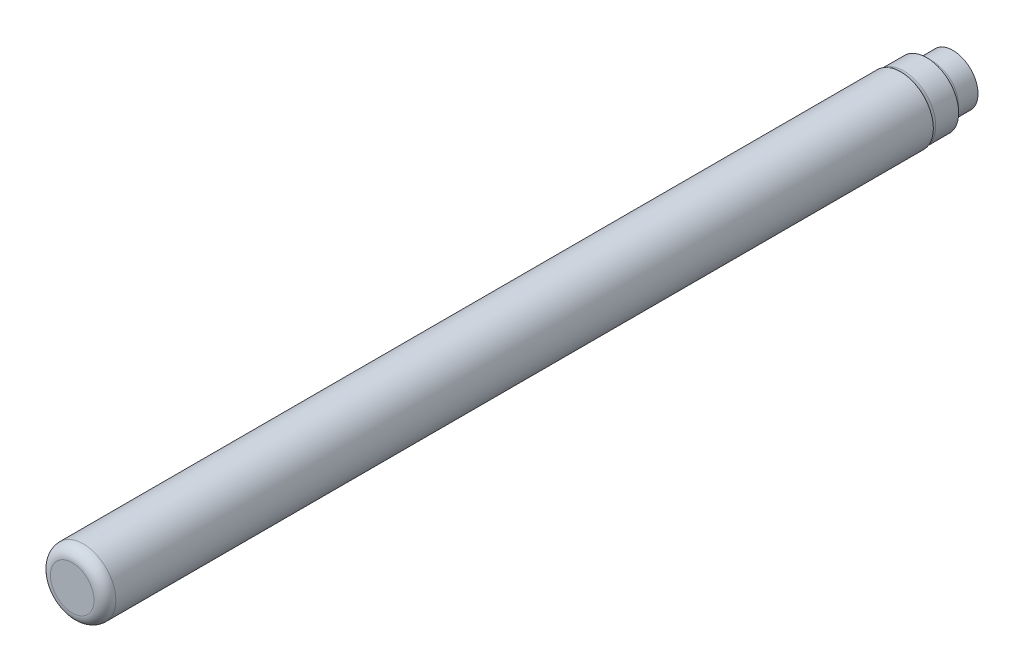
ISO-10303-21;
HEADER;
FILE_DESCRIPTION(('STEP AP214'),'2;1');
FILE_NAME('part.step','',(''),(''),'','','');
FILE_SCHEMA(('AUTOMOTIVE_DESIGN { 1 0 10303 214 1 1 1 1 }'));
ENDSEC;
DATA;
#1=APPLICATION_CONTEXT('core data for automotive mechanical design processes');
#2=APPLICATION_PROTOCOL_DEFINITION('international standard','automotive_design',2000,#1);
#3=PRODUCT_CONTEXT('',#1,'mechanical');
#4=PRODUCT('Part','Part','',(#3));
#5=PRODUCT_RELATED_PRODUCT_CATEGORY('part','',(#4));
#6=PRODUCT_DEFINITION_FORMATION('','',#4);
#7=PRODUCT_DEFINITION_CONTEXT('part definition',#1,'design');
#8=PRODUCT_DEFINITION('design','',#6,#7);
#9=PRODUCT_DEFINITION_SHAPE('','',#8);
#10=(LENGTH_UNIT() NAMED_UNIT(*) SI_UNIT(.MILLI.,.METRE.));
#11=(NAMED_UNIT(*) PLANE_ANGLE_UNIT() SI_UNIT($,.RADIAN.));
#12=(NAMED_UNIT(*) SI_UNIT($,.STERADIAN.) SOLID_ANGLE_UNIT());
#13=UNCERTAINTY_MEASURE_WITH_UNIT(LENGTH_MEASURE(1.E-05),#10,'distance_accuracy_value','');
#14=(GEOMETRIC_REPRESENTATION_CONTEXT(3) GLOBAL_UNCERTAINTY_ASSIGNED_CONTEXT((#13)) GLOBAL_UNIT_ASSIGNED_CONTEXT((#10,
#11,#12)) REPRESENTATION_CONTEXT('',''));
#15=CARTESIAN_POINT('',(0.,0.,0.));
#16=DIRECTION('',(0.,0.,1.));
#17=DIRECTION('',(1.,0.,0.));
#18=AXIS2_PLACEMENT_3D('',#15,#16,#17);
#19=CARTESIAN_POINT('',(0.,0.,190.));
#20=DIRECTION('',(0.,0.,-1.));
#21=DIRECTION('',(-1.,0.,0.));
#22=AXIS2_PLACEMENT_3D('',#19,#20,#21);
#23=CYLINDRICAL_SURFACE('',#22,7.5);
#24=CARTESIAN_POINT('',(0.,0.,187.5));
#25=DIRECTION('',(0.,0.,1.));
#26=DIRECTION('',(1.,0.,0.));
#27=AXIS2_PLACEMENT_3D('',#24,#25,#26);
#28=CIRCLE('',#27,7.5);
#29=CARTESIAN_POINT('',(7.5,0.,187.5));
#30=VERTEX_POINT('',#29);
#31=EDGE_CURVE('E47',#30,#30,#28,.F.);
#32=ORIENTED_EDGE('',*,*,#31,.T.);
#33=EDGE_LOOP('',(#32));
#34=FACE_BOUND('',#33,.T.);
#35=CARTESIAN_POINT('',(0.,0.,0.));
#36=DIRECTION('',(0.,0.,1.));
#37=DIRECTION('',(1.,0.,0.));
#38=AXIS2_PLACEMENT_3D('',#35,#36,#37);
#39=CIRCLE('',#38,7.5);
#40=CARTESIAN_POINT('',(7.5,0.,0.));
#41=VERTEX_POINT('',#40);
#42=EDGE_CURVE('E55',#41,#41,#39,.T.);
#43=ORIENTED_EDGE('',*,*,#42,.T.);
#44=EDGE_LOOP('',(#43));
#45=FACE_BOUND('',#44,.T.);
#46=ADVANCED_FACE('F32',(#34,#45),#23,.T.);
#47=CARTESIAN_POINT('',(0.,0.,190.));
#48=DIRECTION('',(0.,0.,1.));
#49=DIRECTION('',(1.,0.,0.));
#50=AXIS2_PLACEMENT_3D('',#47,#48,#49);
#51=PLANE('',#50);
#52=CARTESIAN_POINT('',(0.,0.,190.));
#53=DIRECTION('',(0.,0.,1.));
#54=DIRECTION('',(1.,0.,0.));
#55=AXIS2_PLACEMENT_3D('',#52,#53,#54);
#56=CIRCLE('',#55,5.);
#57=CARTESIAN_POINT('',(5.,0.,190.));
#58=VERTEX_POINT('',#57);
#59=EDGE_CURVE('E52',#58,#58,#56,.T.);
#60=ORIENTED_EDGE('',*,*,#59,.T.);
#61=EDGE_LOOP('',(#60));
#62=FACE_BOUND('',#61,.T.);
#63=ADVANCED_FACE('F98',(#62),#51,.T.);
#64=CARTESIAN_POINT('',(0.,0.,-6.));
#65=DIRECTION('',(0.,0.,1.));
#66=DIRECTION('',(1.,0.,0.));
#67=AXIS2_PLACEMENT_3D('',#64,#65,#66);
#68=CYLINDRICAL_SURFACE('',#67,7.3);
#69=CARTESIAN_POINT('',(0.,0.,-0.748331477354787));
#70=DIRECTION('',(0.,0.,1.));
#71=DIRECTION('',(1.,0.,0.));
#72=AXIS2_PLACEMENT_3D('',#69,#70,#71);
#73=CIRCLE('',#72,7.3);
#74=CARTESIAN_POINT('',(7.3,0.,-0.748331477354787));
#75=VERTEX_POINT('',#74);
#76=EDGE_CURVE('E43',#75,#75,#73,.F.);
#77=ORIENTED_EDGE('',*,*,#76,.T.);
#78=EDGE_LOOP('',(#77));
#79=FACE_BOUND('',#78,.T.);
#80=CARTESIAN_POINT('',(0.,0.,-6.));
#81=DIRECTION('',(0.,0.,-1.));
#82=DIRECTION('',(-1.,0.,0.));
#83=AXIS2_PLACEMENT_3D('',#80,#81,#82);
#84=CIRCLE('',#83,7.3);
#85=CARTESIAN_POINT('',(-7.3,0.,-6.));
#86=VERTEX_POINT('',#85);
#87=EDGE_CURVE('E58',#86,#86,#84,.T.);
#88=ORIENTED_EDGE('',*,*,#87,.F.);
#89=EDGE_LOOP('',(#88));
#90=FACE_BOUND('',#89,.T.);
#91=ADVANCED_FACE('F104',(#79,#90),#68,.T.);
#92=CARTESIAN_POINT('',(0.,0.,-6.));
#93=DIRECTION('',(0.,0.,-1.));
#94=DIRECTION('',(-1.,0.,0.));
#95=AXIS2_PLACEMENT_3D('',#92,#93,#94);
#96=PLANE('',#95);
#97=CARTESIAN_POINT('',(0.,0.,-6.));
#98=DIRECTION('',(0.,0.,-1.));
#99=DIRECTION('',(-1.,0.,0.));
#100=AXIS2_PLACEMENT_3D('',#97,#98,#99);
#101=CIRCLE('',#100,7.25);
#102=CARTESIAN_POINT('',(-7.25,0.,-6.));
#103=VERTEX_POINT('',#102);
#104=EDGE_CURVE('E10',#103,#103,#101,.F.);
#105=ORIENTED_EDGE('',*,*,#104,.T.);
#106=EDGE_LOOP('',(#105));
#107=FACE_BOUND('',#106,.T.);
#108=ORIENTED_EDGE('',*,*,#87,.T.);
#109=EDGE_LOOP('',(#108));
#110=FACE_BOUND('',#109,.T.);
#111=ADVANCED_FACE('F127',(#107,#110),#96,.T.);
#112=CARTESIAN_POINT('',(0.,0.,-12.));
#113=DIRECTION('',(0.,0.,1.));
#114=DIRECTION('',(1.,0.,0.));
#115=AXIS2_PLACEMENT_3D('',#112,#113,#114);
#116=CYLINDRICAL_SURFACE('',#115,5.75);
#117=CARTESIAN_POINT('',(0.,0.,-7.5));
#118=DIRECTION('',(0.,0.,-1.));
#119=DIRECTION('',(-1.,0.,0.));
#120=AXIS2_PLACEMENT_3D('',#117,#118,#119);
#121=CIRCLE('',#120,5.75);
#122=CARTESIAN_POINT('',(-5.75,0.,-7.5));
#123=VERTEX_POINT('',#122);
#124=EDGE_CURVE('E39',#123,#123,#121,.T.);
#125=ORIENTED_EDGE('',*,*,#124,.T.);
#126=EDGE_LOOP('',(#125));
#127=FACE_BOUND('',#126,.T.);
#128=CARTESIAN_POINT('',(0.,0.,-12.));
#129=DIRECTION('',(0.,0.,-1.));
#130=DIRECTION('',(-1.,0.,0.));
#131=AXIS2_PLACEMENT_3D('',#128,#129,#130);
#132=CIRCLE('',#131,5.75);
#133=CARTESIAN_POINT('',(-5.75,0.,-12.));
#134=VERTEX_POINT('',#133);
#135=EDGE_CURVE('E61',#134,#134,#132,.T.);
#136=ORIENTED_EDGE('',*,*,#135,.F.);
#137=EDGE_LOOP('',(#136));
#138=FACE_BOUND('',#137,.T.);
#139=ADVANCED_FACE('F131',(#127,#138),#116,.T.);
#140=CARTESIAN_POINT('',(0.,0.,-12.));
#141=DIRECTION('',(0.,0.,-1.));
#142=DIRECTION('',(-1.,0.,0.));
#143=AXIS2_PLACEMENT_3D('',#140,#141,#142);
#144=PLANE('',#143);
#145=CARTESIAN_POINT('',(0.,0.,-12.));
#146=DIRECTION('',(0.,0.,1.));
#147=DIRECTION('',(1.,0.,0.));
#148=AXIS2_PLACEMENT_3D('',#145,#146,#147);
#149=CIRCLE('',#148,4.15677609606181);
#150=CARTESIAN_POINT('',(4.15677609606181,0.,-12.));
#151=VERTEX_POINT('',#150);
#152=EDGE_CURVE('E73',#151,#151,#149,.T.);
#153=ORIENTED_EDGE('',*,*,#152,.T.);
#154=EDGE_LOOP('',(#153));
#155=FACE_BOUND('',#154,.T.);
#156=ORIENTED_EDGE('',*,*,#135,.T.);
#157=EDGE_LOOP('',(#156));
#158=FACE_BOUND('',#157,.T.);
#159=ADVANCED_FACE('F113',(#155,#158),#144,.T.);
#160=CARTESIAN_POINT('',(0.,0.,187.5));
#161=DIRECTION('',(0.,0.,1.));
#162=DIRECTION('',(1.,0.,0.));
#163=AXIS2_PLACEMENT_3D('',#160,#161,#162);
#164=TOROIDAL_SURFACE('',#163,5.,2.5);
#165=ORIENTED_EDGE('',*,*,#31,.F.);
#166=EDGE_LOOP('',(#165));
#167=FACE_BOUND('',#166,.T.);
#168=ORIENTED_EDGE('',*,*,#59,.F.);
#169=EDGE_LOOP('',(#168));
#170=FACE_BOUND('',#169,.T.);
#171=ADVANCED_FACE('F110',(#167,#170),#164,.T.);
#172=CARTESIAN_POINT('',(0.,0.,-0.748331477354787));
#173=DIRECTION('',(0.,0.,1.));
#174=DIRECTION('',(1.,0.,0.));
#175=AXIS2_PLACEMENT_3D('',#172,#173,#174);
#176=TOROIDAL_SURFACE('',#175,8.8,1.5);
#177=ORIENTED_EDGE('',*,*,#42,.F.);
#178=EDGE_LOOP('',(#177));
#179=FACE_BOUND('',#178,.T.);
#180=ORIENTED_EDGE('',*,*,#76,.F.);
#181=EDGE_LOOP('',(#180));
#182=FACE_BOUND('',#181,.T.);
#183=ADVANCED_FACE('F112',(#179,#182),#176,.F.);
#184=CARTESIAN_POINT('',(0.,0.,-7.5));
#185=DIRECTION('',(0.,0.,-1.));
#186=DIRECTION('',(-1.,0.,0.));
#187=AXIS2_PLACEMENT_3D('',#184,#185,#186);
#188=TOROIDAL_SURFACE('',#187,7.25,1.5);
#189=ORIENTED_EDGE('',*,*,#104,.F.);
#190=EDGE_LOOP('',(#189));
#191=FACE_BOUND('',#190,.T.);
#192=ORIENTED_EDGE('',*,*,#124,.F.);
#193=EDGE_LOOP('',(#192));
#194=FACE_BOUND('',#193,.T.);
#195=ADVANCED_FACE('F34',(#191,#194),#188,.F.);
#196=CARTESIAN_POINT('',(0.,0.,-5.));
#197=DIRECTION('',(0.,0.,1.));
#198=DIRECTION('',(1.,0.,0.));
#199=AXIS2_PLACEMENT_3D('',#196,#197,#198);
#200=CONICAL_SURFACE('',#199,5.54236812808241,0.127598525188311);
#201=CARTESIAN_POINT('',(0.,0.,-3.2));
#202=DIRECTION('',(0.,0.,1.));
#203=DIRECTION('',(1.,0.,0.));
#204=AXIS2_PLACEMENT_3D('',#201,#202,#203);
#205=CIRCLE('',#204,5.77330013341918);
#206=CARTESIAN_POINT('',(5.77330013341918,0.,-3.2));
#207=VERTEX_POINT('',#206);
#208=EDGE_CURVE('E79',#207,#207,#205,.T.);
#209=ORIENTED_EDGE('',*,*,#208,.T.);
#210=EDGE_LOOP('',(#209));
#211=FACE_BOUND('',#210,.T.);
#212=CARTESIAN_POINT('',(0.,0.,-5.));
#213=DIRECTION('',(0.,0.,1.));
#214=DIRECTION('',(1.,0.,0.));
#215=AXIS2_PLACEMENT_3D('',#212,#213,#214);
#216=CIRCLE('',#215,5.54236812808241);
#217=CARTESIAN_POINT('',(5.54236812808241,0.,-5.));
#218=VERTEX_POINT('',#217);
#219=EDGE_CURVE('E64',#218,#218,#216,.T.);
#220=ORIENTED_EDGE('',*,*,#219,.F.);
#221=EDGE_LOOP('',(#220));
#222=FACE_BOUND('',#221,.T.);
#223=ADVANCED_FACE('F83',(#211,#222),#200,.F.);
#224=CARTESIAN_POINT('',(0.,0.,0.));
#225=DIRECTION('',(0.,0.,1.));
#226=DIRECTION('',(1.,0.,0.));
#227=AXIS2_PLACEMENT_3D('',#224,#225,#226);
#228=CYLINDRICAL_SURFACE('',#227,5.54236812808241);
#229=ORIENTED_EDGE('',*,*,#219,.T.);
#230=EDGE_LOOP('',(#229));
#231=FACE_BOUND('',#230,.T.);
#232=CARTESIAN_POINT('',(0.,0.,-6.));
#233=DIRECTION('',(0.,0.,1.));
#234=DIRECTION('',(1.,0.,0.));
#235=AXIS2_PLACEMENT_3D('',#232,#233,#234);
#236=CIRCLE('',#235,5.54236812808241);
#237=CARTESIAN_POINT('',(5.54236812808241,0.,-6.));
#238=VERTEX_POINT('',#237);
#239=EDGE_CURVE('E67',#238,#238,#236,.T.);
#240=ORIENTED_EDGE('',*,*,#239,.F.);
#241=EDGE_LOOP('',(#240));
#242=FACE_BOUND('',#241,.T.);
#243=ADVANCED_FACE('F143',(#231,#242),#228,.F.);
#244=CARTESIAN_POINT('',(0.,0.,-7.5));
#245=DIRECTION('',(0.,0.,1.));
#246=DIRECTION('',(1.,0.,0.));
#247=AXIS2_PLACEMENT_3D('',#244,#245,#246);
#248=CONICAL_SURFACE('',#247,4.15677609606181,0.745770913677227);
#249=ORIENTED_EDGE('',*,*,#239,.T.);
#250=EDGE_LOOP('',(#249));
#251=FACE_BOUND('',#250,.T.);
#252=CARTESIAN_POINT('',(0.,0.,-7.5));
#253=DIRECTION('',(0.,0.,1.));
#254=DIRECTION('',(1.,0.,0.));
#255=AXIS2_PLACEMENT_3D('',#252,#253,#254);
#256=CIRCLE('',#255,4.15677609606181);
#257=CARTESIAN_POINT('',(4.15677609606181,0.,-7.5));
#258=VERTEX_POINT('',#257);
#259=EDGE_CURVE('E70',#258,#258,#256,.T.);
#260=ORIENTED_EDGE('',*,*,#259,.F.);
#261=EDGE_LOOP('',(#260));
#262=FACE_BOUND('',#261,.T.);
#263=ADVANCED_FACE('F146',(#251,#262),#248,.F.);
#264=CARTESIAN_POINT('',(0.,0.,0.));
#265=DIRECTION('',(0.,0.,1.));
#266=DIRECTION('',(1.,0.,0.));
#267=AXIS2_PLACEMENT_3D('',#264,#265,#266);
#268=CYLINDRICAL_SURFACE('',#267,4.15677609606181);
#269=ORIENTED_EDGE('',*,*,#259,.T.);
#270=EDGE_LOOP('',(#269));
#271=FACE_BOUND('',#270,.T.);
#272=ORIENTED_EDGE('',*,*,#152,.F.);
#273=EDGE_LOOP('',(#272));
#274=FACE_BOUND('',#273,.T.);
#275=ADVANCED_FACE('F94',(#271,#274),#268,.F.);
#276=CARTESIAN_POINT('',(0.,0.,187.5));
#277=DIRECTION('',(0.,0.,-1.));
#278=DIRECTION('',(-1.,0.,0.));
#279=AXIS2_PLACEMENT_3D('',#276,#277,#278);
#280=PLANE('',#279);
#281=CARTESIAN_POINT('',(0.,0.,187.5));
#282=DIRECTION('',(0.,0.,1.));
#283=DIRECTION('',(1.,0.,0.));
#284=AXIS2_PLACEMENT_3D('',#281,#282,#283);
#285=CIRCLE('',#284,5.77330013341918);
#286=CARTESIAN_POINT('',(5.77330013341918,0.,187.5));
#287=VERTEX_POINT('',#286);
#288=EDGE_CURVE('E76',#287,#287,#285,.T.);
#289=ORIENTED_EDGE('',*,*,#288,.F.);
#290=EDGE_LOOP('',(#289));
#291=FACE_BOUND('',#290,.T.);
#292=ADVANCED_FACE('F88',(#291),#280,.T.);
#293=CARTESIAN_POINT('',(0.,0.,0.));
#294=DIRECTION('',(0.,0.,1.));
#295=DIRECTION('',(1.,0.,0.));
#296=AXIS2_PLACEMENT_3D('',#293,#294,#295);
#297=CYLINDRICAL_SURFACE('',#296,5.77330013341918);
#298=ORIENTED_EDGE('',*,*,#288,.T.);
#299=EDGE_LOOP('',(#298));
#300=FACE_BOUND('',#299,.T.);
#301=ORIENTED_EDGE('',*,*,#208,.F.);
#302=EDGE_LOOP('',(#301));
#303=FACE_BOUND('',#302,.T.);
#304=ADVANCED_FACE('F86',(#300,#303),#297,.F.);
#305=CLOSED_SHELL('',(#46,#63,#91,#111,#139,#159,#171,#183,#195,#223,#243,#263,#275,#292,#304));
#306=MANIFOLD_SOLID_BREP('B2',#305);
#307=ADVANCED_BREP_SHAPE_REPRESENTATION('',(#18,#306),#14);
#308=SHAPE_DEFINITION_REPRESENTATION(#9,#307);
ENDSEC;
END-ISO-10303-21;
